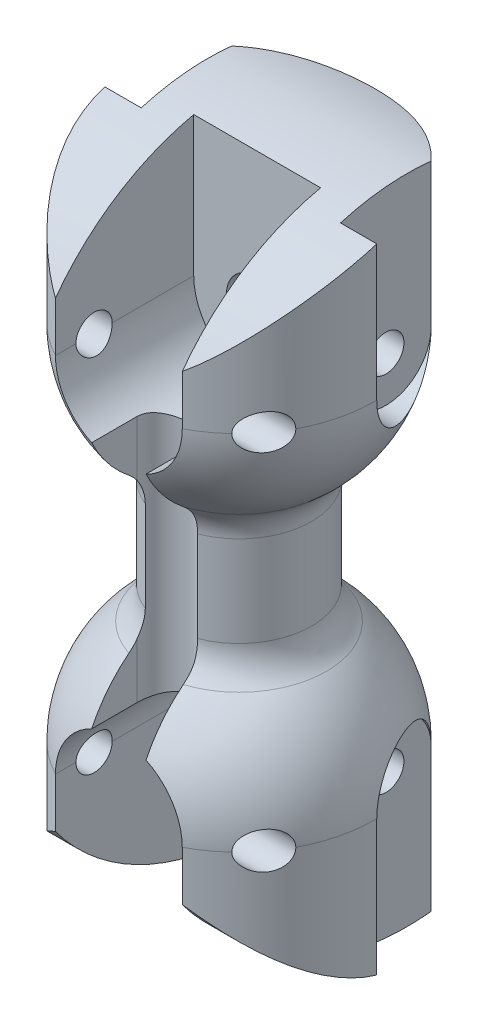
from build123d import *

# Parameters (mm, degrees)
STIRNSENKUNG_F_R_M3_FLACHKOPFSCHRAUBE_MI_D           = 3.4
STIRNSENKUNG_F_R_M3_FLACHKOPFSCHRAUBE_MI_CBORE_D     = 7
STIRNSENKUNG_F_R_M3_FLACHKOPFSCHRAUBE_MI_CBORE_DEPTH = 2.4
SCHNITT_LINEAR_START                                 = 18.88
SCHNITT_LINEAR_AUSTRAGEN3_DEPTH                      = 19.88
SCHNITT_LINEAR_START_2                               = -10
SCHNITT_LINEAR_AUSTRAGEN5_DEPTH                      = 12.6
SCHNITT_LINEAR_AUSTRAGEN6_DEPTH                      = 30.941609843
SCHNITT_LINEAR_AUSTRAGEN6_DEPTH_BACK                 = 30.941609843
SCHNITT_LINEAR_AUSTRAGEN7_DEPTH                      = 10
SKIZZE19_R                                           = 1
SCHNITT_LINEAR_AUSTRAGEN8_DEPTH                      = 30.941610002
KES_EKSTR_ZYON1_DEPTH                                = 2
IZIM2_R                                              = 1
KES_EKSTR_ZYON2_DEPTH                                = 3
AYNALAMA2_COPY_1_DEPTH                               = 2
AYNALAMA2_COPY_2_SKETCH_R                            = 1
AYNALAMA2_COPY_2_DEPTH                               = 3


with BuildPart() as part:
    # Skizze1 → Rotation6 (revolve)
    with BuildSketch(Plane.XY, mode=Mode.PRIVATE) as rotation6_sk:
        with BuildLine():
            Line((0, -7), (0, 27))
            Line((0, 27), (0, 28))
            Line((0, 28), (-7.5, 28))
            Line((-7.5, 28), (-7.5, 20))
            ThreePointArc((-7.5, 20), (-6.79637355, 16.82835901), (-4.817518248, 14.251824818))
            ThreePointArc((-4.817518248, 14.251824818), (-4.214438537, 13.466595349), (-4, 12.5))
            Line((-4, 12.5), (-4, 7.5))
            ThreePointArc((-4, 7.5), (-4.214438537, 6.533404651), (-4.817518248, 5.748175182))
            ThreePointArc((-4.817518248, 5.748175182), (-6.79637355, 3.17164099), (-7.5, 0))
            Line((-7.5, 0), (-7.5, -8))
            Line((-7.5, -8), (0, -8))
            Line((0, -8), (0, -7))
        make_face()
    revolve(rotation6_sk.sketch.rotate(Axis((0, 0, 0), (0, 1, 0)), 270), axis=Axis((0, 0, 0), (0, 1, 0)))

    # Stirnsenkung f_r M3 Flachkopfschraube mi (through all)
    with Locations(Plane.XY.offset(7.5)):
        with Locations((0, 0)):
            stirnsenkung_f_r_m3_flachkopfschraube_mi = CounterBoreHole(STIRNSENKUNG_F_R_M3_FLACHKOPFSCHRAUBE_MI_D / 2, STIRNSENKUNG_F_R_M3_FLACHKOPFSCHRAUBE_MI_CBORE_D / 2, STIRNSENKUNG_F_R_M3_FLACHKOPFSCHRAUBE_MI_CBORE_DEPTH)

    # Skizze10 → Schnitt-Linear austragen3 (cut)
    with BuildSketch(Plane.XY.offset(SCHNITT_LINEAR_START)):
        with BuildLine():
            Line((-3.5, 0), (-3.5, -11.199457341))
            Line((-3.5, -11.199457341), (3.5, -11.199457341))
            Line((3.5, -11.199457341), (3.5, 0))
            ThreePointArc((3.5, 0), (0, 3.5), (-3.5, 0))
        make_face()
    schnitt_linear_austragen3 = extrude(amount=-SCHNITT_LINEAR_AUSTRAGEN3_DEPTH, mode=Mode.SUBTRACT)

    # Spiegeln2: Stirnsenkung f_r M3 Flachkopfschraube mi, Schnitt-Linear austragen3 across plane
    add(stirnsenkung_f_r_m3_flachkopfschraube_mi.mirror(Plane.ZX.offset(10)), mode=Mode.SUBTRACT)
    add(schnitt_linear_austragen3.mirror(Plane.ZX.offset(10)), mode=Mode.SUBTRACT)

    # Skizze14 → Schnitt-Linear austragen5 (cut)
    with BuildSketch(Plane.XY.offset(-7.304792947).offset(SCHNITT_LINEAR_START_2)):
        Polygon((-3.175426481, 20), (-1.58771324, 17.25), (1.58771324, 17.25), (3.175426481, 20), (1.58771324, 22.75), (-1.58771324, 22.75), align=None)
    schnitt_linear_austragen5 = extrude(amount=SCHNITT_LINEAR_AUSTRAGEN5_DEPTH, mode=Mode.SUBTRACT)

    # Spiegeln3: Schnitt-Linear austragen5 across plane
    add(schnitt_linear_austragen5.mirror(Plane.ZX.offset(10)), mode=Mode.SUBTRACT)

    # Skizze15 → Schnitt-Linear austragen6 (cut, two sides: drawn at the far end of the back side and taken through both)
    with BuildSketch(Plane(origin=(0, 0, 0), x_dir=(1, 0, 0), z_dir=(0, 1, 0)).offset(-SCHNITT_LINEAR_AUSTRAGEN6_DEPTH_BACK)):
        with BuildLine():
            Line((-1.5, -4.133249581), (-1.5, -6.633249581))
            Line((-1.5, -6.633249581), (1.5, -6.633249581))
            Line((1.5, -6.633249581), (1.5, -4.133249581))
            ThreePointArc((1.5, -4.133249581), (0, -2.633249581), (-1.5, -4.133249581))
        make_face()
    extrude(amount=SCHNITT_LINEAR_AUSTRAGEN6_DEPTH + SCHNITT_LINEAR_AUSTRAGEN6_DEPTH_BACK, mode=Mode.SUBTRACT)

    # Skizze18 → Schnitt-Linear austragen7 (cut, symmetric)
    with BuildSketch(Plane(origin=(0, 0, 0), x_dir=(0, 0, -1), z_dir=(1, 0, 0))):
        with BuildLine():
            Line((-6.633249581, -2.741859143), (-6.633249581, -13.755143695))
            Line((-6.633249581, -13.755143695), (7.5, -14.06637117))
            Line((7.5, -14.06637117), (7.5, -7.441859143))
            ThreePointArc((7.5, -7.441859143), (-0.314878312, -7.341913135), (-6.633249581, -2.741859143))
        make_face()
    schnitt_linear_austragen7 = extrude(amount=SCHNITT_LINEAR_AUSTRAGEN7_DEPTH, both=True, mode=Mode.SUBTRACT)

    # Spiegeln5: Schnitt-Linear austragen7 across plane
    add(schnitt_linear_austragen7.mirror(Plane.ZX.offset(10)), mode=Mode.SUBTRACT)

    # Skizze19 → Schnitt-Linear austragen8 (cut, symmetric)
    with BuildSketch(Plane(origin=(0, 0, 0), x_dir=(0, 0, -1), z_dir=(1, 0, 0))):
        with Locations((-4.5, 20)):
            Circle(SKIZZE19_R)
    schnitt_linear_austragen8 = extrude(amount=SCHNITT_LINEAR_AUSTRAGEN8_DEPTH, both=True, mode=Mode.SUBTRACT)

    # Spiegeln6: Schnitt-Linear austragen8 across plane
    add(schnitt_linear_austragen8.mirror(Plane.ZX.offset(10)), mode=Mode.SUBTRACT)

    # izim1 → Kes-Ekstr_zyon1 (cut)
    with BuildSketch(Plane(origin=(7.5, 0, 0), x_dir=(0, 0, -1), z_dir=(1, 0, 0))):
        with BuildLine():
            Line((0.1, 20), (0.1, 28.5))
            Line((0.1, 28.5), (5.1, 28.5))
            Line((5.1, 28.5), (5.1, 20))
            ThreePointArc((5.1, 20), (2.6, 17.5), (0.1, 20))
        make_face()
    kes_ekstr_zyon1 = extrude(amount=-KES_EKSTR_ZYON1_DEPTH, mode=Mode.SUBTRACT)

    # izim2 → Kes-Ekstr_zyon2 (cut)
    with BuildSketch(Plane(origin=(5.5, 0, 0), x_dir=(0, 0, -1), z_dir=(1, 0, 0))):
        with Locations((2.6, 20)):
            Circle(IZIM2_R)
    kes_ekstr_zyon2 = extrude(amount=-KES_EKSTR_ZYON2_DEPTH, mode=Mode.SUBTRACT)

    # Aynalama1: Kes-Ekstr_zyon1, Kes-Ekstr_zyon2 across plane
    add(kes_ekstr_zyon1.mirror(Plane.ZX.offset(10)), mode=Mode.SUBTRACT)
    add(kes_ekstr_zyon2.mirror(Plane.ZX.offset(10)), mode=Mode.SUBTRACT)

    # Aynalama2: Kes-Ekstr_zyon1, Kes-Ekstr_zyon2 across plane
    add(kes_ekstr_zyon1.mirror(Plane(origin=(0, 0, 0), x_dir=(0, 0, 1), z_dir=(1, 0, 0))), mode=Mode.SUBTRACT)
    add(kes_ekstr_zyon2.mirror(Plane(origin=(0, 0, 0), x_dir=(0, 0, 1), z_dir=(1, 0, 0))), mode=Mode.SUBTRACT)

    # Aynalama2 copy 1 sketch → Aynalama2 copy 1 (cut)
    with BuildSketch(Plane(origin=(-7.5, 20, 0), x_dir=(0, 0, -1), z_dir=(-1, 0, 0))):
        with BuildLine():
            Line((0.1, 20), (0.1, 28.5))
            Line((0.1, 28.5), (5.1, 28.5))
            Line((5.1, 28.5), (5.1, 20))
            ThreePointArc((5.1, 20), (2.6, 17.5), (0.1, 20))
        make_face()
    extrude(amount=-AYNALAMA2_COPY_1_DEPTH, mode=Mode.SUBTRACT)

    # Aynalama2 copy 2 sketch → Aynalama2 copy 2 (cut)
    with BuildSketch(Plane(origin=(-5.5, 20, 0), x_dir=(0, 0, -1), z_dir=(-1, 0, 0))):
        with Locations((2.6, 20)):
            Circle(AYNALAMA2_COPY_2_SKETCH_R)
    extrude(amount=-AYNALAMA2_COPY_2_DEPTH, mode=Mode.SUBTRACT)


solid = part.part
